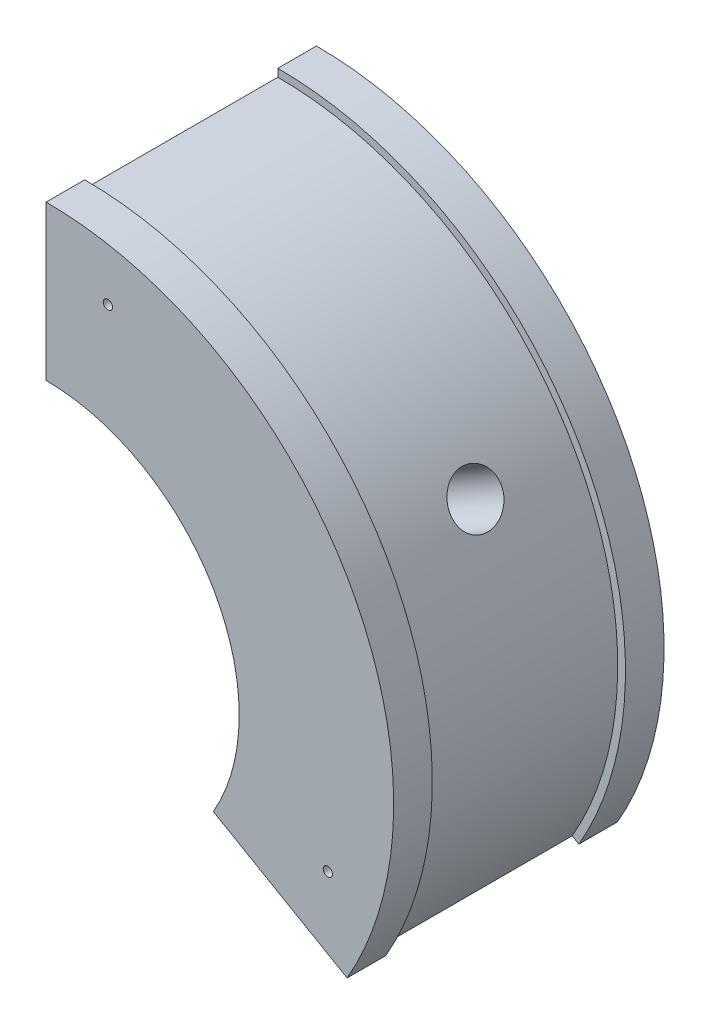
ISO-10303-21;
HEADER;
FILE_DESCRIPTION(('STEP AP214'),'2;1');
FILE_NAME('part.step','',(''),(''),'','','');
FILE_SCHEMA(('AUTOMOTIVE_DESIGN { 1 0 10303 214 1 1 1 1 }'));
ENDSEC;
DATA;
#1=APPLICATION_CONTEXT('core data for automotive mechanical design processes');
#2=APPLICATION_PROTOCOL_DEFINITION('international standard','automotive_design',2000,#1);
#3=PRODUCT_CONTEXT('',#1,'mechanical');
#4=PRODUCT('Part','Part','',(#3));
#5=PRODUCT_RELATED_PRODUCT_CATEGORY('part','',(#4));
#6=PRODUCT_DEFINITION_FORMATION('','',#4);
#7=PRODUCT_DEFINITION_CONTEXT('part definition',#1,'design');
#8=PRODUCT_DEFINITION('design','',#6,#7);
#9=PRODUCT_DEFINITION_SHAPE('','',#8);
#10=(LENGTH_UNIT() NAMED_UNIT(*) SI_UNIT(.MILLI.,.METRE.));
#11=(NAMED_UNIT(*) PLANE_ANGLE_UNIT() SI_UNIT($,.RADIAN.));
#12=(NAMED_UNIT(*) SI_UNIT($,.STERADIAN.) SOLID_ANGLE_UNIT());
#13=UNCERTAINTY_MEASURE_WITH_UNIT(LENGTH_MEASURE(1.E-05),#10,'distance_accuracy_value','');
#14=(GEOMETRIC_REPRESENTATION_CONTEXT(3) GLOBAL_UNCERTAINTY_ASSIGNED_CONTEXT((#13)) GLOBAL_UNIT_ASSIGNED_CONTEXT((#10,
#11,#12)) REPRESENTATION_CONTEXT('',''));
#15=CARTESIAN_POINT('',(0.,0.,0.));
#16=DIRECTION('',(0.,0.,1.));
#17=DIRECTION('',(1.,0.,0.));
#18=AXIS2_PLACEMENT_3D('',#15,#16,#17);
#19=CARTESIAN_POINT('',(0.,0.,35.));
#20=DIRECTION('',(0.,0.,-1.));
#21=DIRECTION('',(-1.,0.,0.));
#22=AXIS2_PLACEMENT_3D('',#19,#20,#21);
#23=CYLINDRICAL_SURFACE('',#22,45.);
#24=CARTESIAN_POINT('',(0.,0.,5.));
#25=DIRECTION('',(0.,0.,1.));
#26=DIRECTION('',(1.,0.,0.));
#27=AXIS2_PLACEMENT_3D('',#24,#25,#26);
#28=CIRCLE('',#27,45.);
#29=CARTESIAN_POINT('',(38.9711431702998,-22.4999999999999,5.));
#30=VERTEX_POINT('',#29);
#31=CARTESIAN_POINT('',(0.,45.,5.));
#32=VERTEX_POINT('',#31);
#33=EDGE_CURVE('E170',#30,#32,#28,.T.);
#34=ORIENTED_EDGE('',*,*,#33,.F.);
#35=DIRECTION('',(0.,0.,-1.));
#36=VECTOR('',#35,1.);
#37=CARTESIAN_POINT('',(38.9711431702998,-22.4999999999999,35.));
#38=LINE('',#37,#36);
#39=CARTESIAN_POINT('',(38.9711431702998,-22.4999999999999,0.));
#40=VERTEX_POINT('',#39);
#41=EDGE_CURVE('E281',#30,#40,#38,.T.);
#42=ORIENTED_EDGE('',*,*,#41,.T.);
#43=CARTESIAN_POINT('',(0.,0.,0.));
#44=DIRECTION('',(0.,0.,1.));
#45=DIRECTION('',(1.,0.,0.));
#46=AXIS2_PLACEMENT_3D('',#43,#44,#45);
#47=CIRCLE('',#46,45.);
#48=CARTESIAN_POINT('',(0.,45.,0.));
#49=VERTEX_POINT('',#48);
#50=EDGE_CURVE('E321',#40,#49,#47,.T.);
#51=ORIENTED_EDGE('',*,*,#50,.T.);
#52=DIRECTION('',(0.,0.,-1.));
#53=VECTOR('',#52,1.);
#54=CARTESIAN_POINT('',(0.,45.,35.));
#55=LINE('',#54,#53);
#56=EDGE_CURVE('E295',#32,#49,#55,.T.);
#57=ORIENTED_EDGE('',*,*,#56,.F.);
#58=EDGE_LOOP('',(#34,#42,#51,#57));
#59=FACE_BOUND('',#58,.T.);
#60=ADVANCED_FACE('F32',(#59),#23,.T.);
#61=CARTESIAN_POINT('',(0.,0.,35.));
#62=DIRECTION('',(0.,0.,-1.));
#63=DIRECTION('',(-1.,0.,0.));
#64=AXIS2_PLACEMENT_3D('',#61,#62,#63);
#65=CYLINDRICAL_SURFACE('',#64,25.);
#66=CARTESIAN_POINT('',(0.,0.,5.));
#67=DIRECTION('',(0.,0.,1.));
#68=DIRECTION('',(1.,0.,0.));
#69=AXIS2_PLACEMENT_3D('',#66,#67,#68);
#70=CIRCLE('',#69,25.);
#71=CARTESIAN_POINT('',(0.,25.,5.));
#72=VERTEX_POINT('',#71);
#73=CARTESIAN_POINT('',(21.650635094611,-12.5,5.));
#74=VERTEX_POINT('',#73);
#75=EDGE_CURVE('E61',#72,#74,#70,.F.);
#76=ORIENTED_EDGE('',*,*,#75,.F.);
#77=DIRECTION('',(0.,0.,-1.));
#78=VECTOR('',#77,1.);
#79=CARTESIAN_POINT('',(0.,25.,35.));
#80=LINE('',#79,#78);
#81=CARTESIAN_POINT('',(0.,25.,0.));
#82=VERTEX_POINT('',#81);
#83=EDGE_CURVE('E291',#72,#82,#80,.T.);
#84=ORIENTED_EDGE('',*,*,#83,.T.);
#85=CARTESIAN_POINT('',(0.,0.,0.));
#86=DIRECTION('',(0.,0.,-1.));
#87=DIRECTION('',(1.,0.,0.));
#88=AXIS2_PLACEMENT_3D('',#85,#86,#87);
#89=CIRCLE('',#88,25.);
#90=CARTESIAN_POINT('',(21.650635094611,-12.5,0.));
#91=VERTEX_POINT('',#90);
#92=EDGE_CURVE('E319',#82,#91,#89,.T.);
#93=ORIENTED_EDGE('',*,*,#92,.T.);
#94=DIRECTION('',(0.,0.,-1.));
#95=VECTOR('',#94,1.);
#96=CARTESIAN_POINT('',(21.650635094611,-12.5,35.));
#97=LINE('',#96,#95);
#98=EDGE_CURVE('E280',#74,#91,#97,.T.);
#99=ORIENTED_EDGE('',*,*,#98,.F.);
#100=EDGE_LOOP('',(#76,#84,#93,#99));
#101=FACE_BOUND('',#100,.T.);
#102=ADVANCED_FACE('F254',(#101),#65,.F.);
#103=CARTESIAN_POINT('',(38.9711431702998,-22.4999999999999,35.));
#104=VERTEX_POINT('',#103);
#105=CARTESIAN_POINT('',(38.9711431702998,-22.4999999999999,30.));
#106=VERTEX_POINT('',#105);
#107=EDGE_CURVE('E273',#104,#106,#38,.T.);
#108=ORIENTED_EDGE('',*,*,#107,.T.);
#109=CARTESIAN_POINT('',(0.,0.,30.));
#110=DIRECTION('',(0.,0.,1.));
#111=DIRECTION('',(1.,0.,0.));
#112=AXIS2_PLACEMENT_3D('',#109,#110,#111);
#113=CIRCLE('',#112,45.);
#114=CARTESIAN_POINT('',(0.,45.,30.));
#115=VERTEX_POINT('',#114);
#116=EDGE_CURVE('E174',#106,#115,#113,.T.);
#117=ORIENTED_EDGE('',*,*,#116,.T.);
#118=CARTESIAN_POINT('',(0.,45.,35.));
#119=VERTEX_POINT('',#118);
#120=EDGE_CURVE('E296',#119,#115,#55,.T.);
#121=ORIENTED_EDGE('',*,*,#120,.F.);
#122=CARTESIAN_POINT('',(0.,0.,35.));
#123=DIRECTION('',(0.,0.,1.));
#124=DIRECTION('',(1.,0.,0.));
#125=AXIS2_PLACEMENT_3D('',#122,#123,#124);
#126=CIRCLE('',#125,45.);
#127=EDGE_CURVE('E277',#104,#119,#126,.T.);
#128=ORIENTED_EDGE('',*,*,#127,.F.);
#129=EDGE_LOOP('',(#108,#117,#121,#128));
#130=FACE_BOUND('',#129,.T.);
#131=ADVANCED_FACE('F34',(#130),#23,.T.);
#132=CARTESIAN_POINT('',(0.,45.,35.));
#133=DIRECTION('',(1.,0.,0.));
#134=DIRECTION('',(0.,1.,0.));
#135=AXIS2_PLACEMENT_3D('',#132,#133,#134);
#136=PLANE('',#135);
#137=CARTESIAN_POINT('',(0.,37.,17.5));
#138=DIRECTION('',(-1.,0.,0.));
#139=DIRECTION('',(0.,0.,1.));
#140=AXIS2_PLACEMENT_3D('',#137,#138,#139);
#141=CIRCLE('',#140,2.75);
#142=CARTESIAN_POINT('',(0.,37.,20.25));
#143=VERTEX_POINT('',#142);
#144=EDGE_CURVE('E156',#143,#143,#141,.T.);
#145=ORIENTED_EDGE('',*,*,#144,.F.);
#146=EDGE_LOOP('',(#145));
#147=FACE_BOUND('',#146,.T.);
#148=ORIENTED_EDGE('',*,*,#120,.T.);
#149=DIRECTION('',(0.,-1.,0.));
#150=VECTOR('',#149,1.);
#151=CARTESIAN_POINT('',(0.,45.,30.));
#152=LINE('',#151,#150);
#153=CARTESIAN_POINT('',(0.,44.,30.));
#154=VERTEX_POINT('',#153);
#155=EDGE_CURVE('E177',#115,#154,#152,.T.);
#156=ORIENTED_EDGE('',*,*,#155,.T.);
#157=DIRECTION('',(0.,0.,-1.));
#158=VECTOR('',#157,1.);
#159=CARTESIAN_POINT('',(0.,44.,30.));
#160=LINE('',#159,#158);
#161=CARTESIAN_POINT('',(0.,44.,5.));
#162=VERTEX_POINT('',#161);
#163=EDGE_CURVE('E167',#154,#162,#160,.T.);
#164=ORIENTED_EDGE('',*,*,#163,.T.);
#165=DIRECTION('',(0.,-1.,0.));
#166=VECTOR('',#165,1.);
#167=CARTESIAN_POINT('',(0.,45.,5.));
#168=LINE('',#167,#166);
#169=EDGE_CURVE('E172',#32,#162,#168,.T.);
#170=ORIENTED_EDGE('',*,*,#169,.F.);
#171=ORIENTED_EDGE('',*,*,#56,.T.);
#172=DIRECTION('',(0.,-1.,0.));
#173=VECTOR('',#172,1.);
#174=CARTESIAN_POINT('',(0.,45.,0.));
#175=LINE('',#174,#173);
#176=EDGE_CURVE('E324',#49,#82,#175,.T.);
#177=ORIENTED_EDGE('',*,*,#176,.T.);
#178=ORIENTED_EDGE('',*,*,#83,.F.);
#179=DIRECTION('',(0.,-1.,0.));
#180=VECTOR('',#179,1.);
#181=CARTESIAN_POINT('',(0.,45.,5.));
#182=LINE('',#181,#180);
#183=CARTESIAN_POINT('',(0.,30.,5.));
#184=VERTEX_POINT('',#183);
#185=EDGE_CURVE('E353',#184,#72,#182,.T.);
#186=ORIENTED_EDGE('',*,*,#185,.F.);
#187=DIRECTION('',(0.,0.,-1.));
#188=VECTOR('',#187,1.);
#189=CARTESIAN_POINT('',(0.,30.,30.));
#190=LINE('',#189,#188);
#191=CARTESIAN_POINT('',(0.,30.,30.));
#192=VERTEX_POINT('',#191);
#193=EDGE_CURVE('E325',#192,#184,#190,.T.);
#194=ORIENTED_EDGE('',*,*,#193,.F.);
#195=DIRECTION('',(0.,-1.,0.));
#196=VECTOR('',#195,1.);
#197=CARTESIAN_POINT('',(0.,45.,30.));
#198=LINE('',#197,#196);
#199=CARTESIAN_POINT('',(0.,25.,30.));
#200=VERTEX_POINT('',#199);
#201=EDGE_CURVE('E328',#192,#200,#198,.T.);
#202=ORIENTED_EDGE('',*,*,#201,.T.);
#203=CARTESIAN_POINT('',(0.,25.,35.));
#204=VERTEX_POINT('',#203);
#205=EDGE_CURVE('E292',#204,#200,#80,.T.);
#206=ORIENTED_EDGE('',*,*,#205,.F.);
#207=DIRECTION('',(0.,-1.,0.));
#208=VECTOR('',#207,1.);
#209=CARTESIAN_POINT('',(0.,45.,35.));
#210=LINE('',#209,#208);
#211=EDGE_CURVE('E339',#119,#204,#210,.T.);
#212=ORIENTED_EDGE('',*,*,#211,.F.);
#213=EDGE_LOOP('',(#148,#156,#164,#170,#171,#177,#178,#186,#194,#202,#206,#212));
#214=FACE_BOUND('',#213,.T.);
#215=ADVANCED_FACE('F264',(#147,#214),#136,.F.);
#216=ORIENTED_EDGE('',*,*,#205,.T.);
#217=CARTESIAN_POINT('',(0.,0.,30.));
#218=DIRECTION('',(0.,0.,1.));
#219=DIRECTION('',(1.,0.,0.));
#220=AXIS2_PLACEMENT_3D('',#217,#218,#219);
#221=CIRCLE('',#220,25.);
#222=CARTESIAN_POINT('',(21.650635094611,-12.4999999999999,30.));
#223=VERTEX_POINT('',#222);
#224=EDGE_CURVE('E351',#200,#223,#221,.F.);
#225=ORIENTED_EDGE('',*,*,#224,.T.);
#226=CARTESIAN_POINT('',(21.650635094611,-12.5,35.));
#227=VERTEX_POINT('',#226);
#228=EDGE_CURVE('E283',#227,#223,#97,.T.);
#229=ORIENTED_EDGE('',*,*,#228,.F.);
#230=CARTESIAN_POINT('',(0.,0.,35.));
#231=DIRECTION('',(0.,0.,-1.));
#232=DIRECTION('',(1.,0.,0.));
#233=AXIS2_PLACEMENT_3D('',#230,#231,#232);
#234=CIRCLE('',#233,25.);
#235=EDGE_CURVE('E343',#204,#227,#234,.T.);
#236=ORIENTED_EDGE('',*,*,#235,.F.);
#237=EDGE_LOOP('',(#216,#225,#229,#236));
#238=FACE_BOUND('',#237,.T.);
#239=ADVANCED_FACE('F261',(#238),#65,.F.);
#240=CARTESIAN_POINT('',(21.650635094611,-12.4999999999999,35.));
#241=DIRECTION('',(0.499999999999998,0.86602540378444,0.));
#242=DIRECTION('',(-0.86602540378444,0.499999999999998,0.));
#243=AXIS2_PLACEMENT_3D('',#240,#241,#242);
#244=PLANE('',#243);
#245=CARTESIAN_POINT('',(32.0429399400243,-18.4999999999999,17.5));
#246=DIRECTION('',(-0.499999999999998,-0.86602540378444,0.));
#247=DIRECTION('',(0.86602540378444,-0.499999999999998,0.));
#248=AXIS2_PLACEMENT_3D('',#245,#246,#247);
#249=CIRCLE('',#248,2.75);
#250=CARTESIAN_POINT('',(34.4245098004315,-19.8749999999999,17.5));
#251=VERTEX_POINT('',#250);
#252=EDGE_CURVE('E141',#251,#251,#249,.T.);
#253=ORIENTED_EDGE('',*,*,#252,.F.);
#254=EDGE_LOOP('',(#253));
#255=FACE_BOUND('',#254,.T.);
#256=DIRECTION('',(0.,0.,-1.));
#257=VECTOR('',#256,1.);
#258=CARTESIAN_POINT('',(38.1051177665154,-21.9999999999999,30.));
#259=LINE('',#258,#257);
#260=CARTESIAN_POINT('',(38.1051177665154,-21.9999999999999,5.));
#261=VERTEX_POINT('',#260);
#262=CARTESIAN_POINT('',(38.1051177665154,-21.9999999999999,30.));
#263=VERTEX_POINT('',#262);
#264=EDGE_CURVE('E164',#261,#263,#259,.F.);
#265=ORIENTED_EDGE('',*,*,#264,.T.);
#266=DIRECTION('',(0.86602540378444,-0.499999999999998,0.));
#267=VECTOR('',#266,1.);
#268=CARTESIAN_POINT('',(21.650635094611,-12.4999999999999,30.));
#269=LINE('',#268,#267);
#270=EDGE_CURVE('E12',#263,#106,#269,.T.);
#271=ORIENTED_EDGE('',*,*,#270,.T.);
#272=ORIENTED_EDGE('',*,*,#107,.F.);
#273=DIRECTION('',(0.86602540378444,-0.499999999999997,0.));
#274=VECTOR('',#273,1.);
#275=CARTESIAN_POINT('',(21.650635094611,-12.4999999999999,35.));
#276=LINE('',#275,#274);
#277=EDGE_CURVE('E285',#227,#104,#276,.T.);
#278=ORIENTED_EDGE('',*,*,#277,.F.);
#279=ORIENTED_EDGE('',*,*,#228,.T.);
#280=DIRECTION('',(0.86602540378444,-0.499999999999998,0.));
#281=VECTOR('',#280,1.);
#282=CARTESIAN_POINT('',(21.650635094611,-12.4999999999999,30.));
#283=LINE('',#282,#281);
#284=CARTESIAN_POINT('',(25.9807621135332,-14.9999999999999,30.));
#285=VERTEX_POINT('',#284);
#286=EDGE_CURVE('E209',#223,#285,#283,.T.);
#287=ORIENTED_EDGE('',*,*,#286,.T.);
#288=DIRECTION('',(0.,0.,-1.));
#289=VECTOR('',#288,1.);
#290=CARTESIAN_POINT('',(25.9807621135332,-14.9999999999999,30.));
#291=LINE('',#290,#289);
#292=CARTESIAN_POINT('',(25.9807621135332,-14.9999999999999,5.));
#293=VERTEX_POINT('',#292);
#294=EDGE_CURVE('E299',#293,#285,#291,.F.);
#295=ORIENTED_EDGE('',*,*,#294,.F.);
#296=DIRECTION('',(0.86602540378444,-0.499999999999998,0.));
#297=VECTOR('',#296,1.);
#298=CARTESIAN_POINT('',(21.650635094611,-12.4999999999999,5.));
#299=LINE('',#298,#297);
#300=EDGE_CURVE('E298',#74,#293,#299,.T.);
#301=ORIENTED_EDGE('',*,*,#300,.F.);
#302=ORIENTED_EDGE('',*,*,#98,.T.);
#303=DIRECTION('',(0.86602540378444,-0.499999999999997,0.));
#304=VECTOR('',#303,1.);
#305=CARTESIAN_POINT('',(21.650635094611,-12.4999999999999,0.));
#306=LINE('',#305,#304);
#307=EDGE_CURVE('E287',#91,#40,#306,.T.);
#308=ORIENTED_EDGE('',*,*,#307,.T.);
#309=ORIENTED_EDGE('',*,*,#41,.F.);
#310=DIRECTION('',(0.86602540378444,-0.499999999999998,0.));
#311=VECTOR('',#310,1.);
#312=CARTESIAN_POINT('',(21.650635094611,-12.4999999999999,5.));
#313=LINE('',#312,#311);
#314=EDGE_CURVE('E45',#261,#30,#313,.T.);
#315=ORIENTED_EDGE('',*,*,#314,.F.);
#316=EDGE_LOOP('',(#265,#271,#272,#278,#279,#287,#295,#301,#302,#308,#309,#315));
#317=FACE_BOUND('',#316,.T.);
#318=ADVANCED_FACE('F312',(#255,#317),#244,.F.);
#319=CARTESIAN_POINT('',(0.,0.,35.));
#320=DIRECTION('',(0.,0.,1.));
#321=DIRECTION('',(1.,0.,0.));
#322=AXIS2_PLACEMENT_3D('',#319,#320,#321);
#323=PLANE('',#322);
#324=CARTESIAN_POINT('',(36.4759526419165,-11.8217967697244,35.));
#325=DIRECTION('',(0.,0.,1.));
#326=DIRECTION('',(1.,0.,0.));
#327=AXIS2_PLACEMENT_3D('',#324,#325,#326);
#328=CIRCLE('',#327,0.599999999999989);
#329=CARTESIAN_POINT('',(37.0759526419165,-11.8217967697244,35.));
#330=VERTEX_POINT('',#329);
#331=EDGE_CURVE('E439',#330,#330,#328,.T.);
#332=ORIENTED_EDGE('',*,*,#331,.F.);
#333=EDGE_LOOP('',(#332));
#334=FACE_BOUND('',#333,.T.);
#335=CARTESIAN_POINT('',(8.,37.5,35.));
#336=DIRECTION('',(0.,0.,1.));
#337=DIRECTION('',(1.,0.,0.));
#338=AXIS2_PLACEMENT_3D('',#335,#336,#337);
#339=CIRCLE('',#338,0.599999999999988);
#340=CARTESIAN_POINT('',(8.59999999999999,37.5,35.));
#341=VERTEX_POINT('',#340);
#342=EDGE_CURVE('E151',#341,#341,#339,.T.);
#343=ORIENTED_EDGE('',*,*,#342,.F.);
#344=EDGE_LOOP('',(#343));
#345=FACE_BOUND('',#344,.T.);
#346=ORIENTED_EDGE('',*,*,#127,.T.);
#347=ORIENTED_EDGE('',*,*,#211,.T.);
#348=ORIENTED_EDGE('',*,*,#235,.T.);
#349=ORIENTED_EDGE('',*,*,#277,.T.);
#350=EDGE_LOOP('',(#346,#347,#348,#349));
#351=FACE_BOUND('',#350,.T.);
#352=ADVANCED_FACE('F345',(#334,#345,#351),#323,.T.);
#353=CARTESIAN_POINT('',(0.,0.,0.));
#354=DIRECTION('',(0.,0.,1.));
#355=DIRECTION('',(1.,0.,0.));
#356=AXIS2_PLACEMENT_3D('',#353,#354,#355);
#357=PLANE('',#356);
#358=CARTESIAN_POINT('',(36.4759526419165,-11.8217967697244,0.));
#359=DIRECTION('',(0.,0.,1.));
#360=DIRECTION('',(1.,0.,0.));
#361=AXIS2_PLACEMENT_3D('',#358,#359,#360);
#362=CIRCLE('',#361,0.599999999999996);
#363=CARTESIAN_POINT('',(37.0759526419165,-11.8217967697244,0.));
#364=VERTEX_POINT('',#363);
#365=EDGE_CURVE('E434',#364,#364,#362,.T.);
#366=ORIENTED_EDGE('',*,*,#365,.T.);
#367=EDGE_LOOP('',(#366));
#368=FACE_BOUND('',#367,.T.);
#369=CARTESIAN_POINT('',(8.,37.5,0.));
#370=DIRECTION('',(0.,0.,1.));
#371=DIRECTION('',(1.,0.,0.));
#372=AXIS2_PLACEMENT_3D('',#369,#370,#371);
#373=CIRCLE('',#372,0.599999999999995);
#374=CARTESIAN_POINT('',(8.59999999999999,37.5,0.));
#375=VERTEX_POINT('',#374);
#376=EDGE_CURVE('E436',#375,#375,#373,.T.);
#377=ORIENTED_EDGE('',*,*,#376,.T.);
#378=EDGE_LOOP('',(#377));
#379=FACE_BOUND('',#378,.T.);
#380=ORIENTED_EDGE('',*,*,#50,.F.);
#381=ORIENTED_EDGE('',*,*,#307,.F.);
#382=ORIENTED_EDGE('',*,*,#92,.F.);
#383=ORIENTED_EDGE('',*,*,#176,.F.);
#384=EDGE_LOOP('',(#380,#381,#382,#383));
#385=FACE_BOUND('',#384,.T.);
#386=ADVANCED_FACE('F322',(#368,#379,#385),#357,.F.);
#387=CARTESIAN_POINT('',(0.,0.,30.));
#388=DIRECTION('',(0.,0.,-1.));
#389=DIRECTION('',(-1.,0.,0.));
#390=AXIS2_PLACEMENT_3D('',#387,#388,#389);
#391=CYLINDRICAL_SURFACE('',#390,30.);
#392=CARTESIAN_POINT('',(27.473562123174,12.0500366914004,17.5));
#393=CARTESIAN_POINT('',(27.4735601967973,12.0500447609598,17.6847593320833));
#394=CARTESIAN_POINT('',(27.4672815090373,12.0643877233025,17.8696383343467));
#395=CARTESIAN_POINT('',(27.4422068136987,12.1213124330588,18.2342632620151));
#396=CARTESIAN_POINT('',(27.423397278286,12.1639246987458,18.4140034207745));
#397=CARTESIAN_POINT('',(27.3734486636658,12.2759131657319,18.7630179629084));
#398=CARTESIAN_POINT('',(27.3423173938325,12.3452724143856,18.9322988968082));
#399=CARTESIAN_POINT('',(27.2680626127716,12.5084274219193,19.2557296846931));
#400=CARTESIAN_POINT('',(27.2249413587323,12.6022185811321,19.4098823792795));
#401=CARTESIAN_POINT('',(27.1270332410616,12.8116134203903,19.6993892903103));
#402=CARTESIAN_POINT('',(27.0722016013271,12.9273006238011,19.8346679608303));
#403=CARTESIAN_POINT('',(26.9517516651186,13.1765778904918,20.0819354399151));
#404=CARTESIAN_POINT('',(26.8861328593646,13.3101687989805,20.1939231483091));
#405=CARTESIAN_POINT('',(26.7450358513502,13.5914620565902,20.3916953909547));
#406=CARTESIAN_POINT('',(26.6695329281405,13.7391995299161,20.4774123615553));
#407=CARTESIAN_POINT('',(26.5103121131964,14.0439623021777,20.6197775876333));
#408=CARTESIAN_POINT('',(26.4265944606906,14.2009873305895,20.6764266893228));
#409=CARTESIAN_POINT('',(26.2532476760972,14.518940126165,20.7588248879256));
#410=CARTESIAN_POINT('',(26.1636439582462,14.6798494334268,20.7846986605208));
#411=CARTESIAN_POINT('',(25.9805778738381,15.0014599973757,20.8051976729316));
#412=CARTESIAN_POINT('',(25.8871156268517,15.162161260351,20.7998238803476));
#413=CARTESIAN_POINT('',(25.6994620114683,15.4780901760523,20.7580810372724));
#414=CARTESIAN_POINT('',(25.6052755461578,15.6333384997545,20.721846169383));
#415=CARTESIAN_POINT('',(25.4187211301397,15.9348696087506,20.6196189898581));
#416=CARTESIAN_POINT('',(25.3263532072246,16.0811522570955,20.5536262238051));
#417=CARTESIAN_POINT('',(25.1463255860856,16.3612381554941,20.3936114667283));
#418=CARTESIAN_POINT('',(25.0586762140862,16.4950144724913,20.2995307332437));
#419=CARTESIAN_POINT('',(24.8913832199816,16.746398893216,20.0860533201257));
#420=CARTESIAN_POINT('',(24.8117398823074,16.8640064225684,19.9666557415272));
#421=CARTESIAN_POINT('',(24.6630093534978,17.0807897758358,19.7051810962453));
#422=CARTESIAN_POINT('',(24.5939802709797,17.1798647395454,19.5629873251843));
#423=CARTESIAN_POINT('',(24.4696836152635,17.3564478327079,19.2603598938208));
#424=CARTESIAN_POINT('',(24.4144160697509,17.4339559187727,19.0999261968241));
#425=CARTESIAN_POINT('',(24.3198792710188,17.5655934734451,18.7652778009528));
#426=CARTESIAN_POINT('',(24.2806145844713,17.6197162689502,18.591059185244));
#427=CARTESIAN_POINT('',(24.2197674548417,17.7032640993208,18.2338345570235));
#428=CARTESIAN_POINT('',(24.1981843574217,17.7326900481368,18.050828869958));
#429=CARTESIAN_POINT('',(24.1736979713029,17.766056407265,17.6822485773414));
#430=CARTESIAN_POINT('',(24.1706976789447,17.770129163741,17.4966923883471));
#431=CARTESIAN_POINT('',(24.1832480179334,17.7530454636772,17.1273803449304));
#432=CARTESIAN_POINT('',(24.1987983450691,17.7318894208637,16.9436244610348));
#433=CARTESIAN_POINT('',(24.2477150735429,17.6649372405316,16.5836097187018));
#434=CARTESIAN_POINT('',(24.2810356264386,17.6192045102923,16.4073328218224));
#435=CARTESIAN_POINT('',(24.3640640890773,17.5042103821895,16.0667178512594));
#436=CARTESIAN_POINT('',(24.4137724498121,17.4349483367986,15.9023801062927));
#437=CARTESIAN_POINT('',(24.5277909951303,17.2741767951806,15.5895668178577));
#438=CARTESIAN_POINT('',(24.5921603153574,17.182577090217,15.441159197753));
#439=CARTESIAN_POINT('',(24.7328534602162,16.9794342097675,15.1651092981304));
#440=CARTESIAN_POINT('',(24.8091776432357,16.8678904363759,15.0374676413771));
#441=CARTESIAN_POINT('',(24.9712614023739,16.6270030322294,14.8060066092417));
#442=CARTESIAN_POINT('',(25.0570608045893,16.4975836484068,14.7022939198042));
#443=CARTESIAN_POINT('',(25.2347056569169,16.2245529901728,14.5223705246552));
#444=CARTESIAN_POINT('',(25.3265510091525,16.0809419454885,14.4461593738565));
#445=CARTESIAN_POINT('',(25.5129191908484,15.7835880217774,14.3235817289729));
#446=CARTESIAN_POINT('',(25.6074358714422,15.6298674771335,14.2771517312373));
#447=CARTESIAN_POINT('',(25.7962699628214,15.3161989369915,14.2152472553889));
#448=CARTESIAN_POINT('',(25.8905873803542,15.1562511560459,14.1997717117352));
#449=CARTESIAN_POINT('',(26.0756972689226,14.8355020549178,14.2002321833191));
#450=CARTESIAN_POINT('',(26.1665057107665,14.6747096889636,14.2160029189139));
#451=CARTESIAN_POINT('',(26.3426655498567,14.3560831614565,14.2781603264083));
#452=CARTESIAN_POINT('',(26.4280169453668,14.1982490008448,14.3245470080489));
#453=CARTESIAN_POINT('',(26.5911971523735,13.8902350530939,14.4465715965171));
#454=CARTESIAN_POINT('',(26.6690274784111,13.7400537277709,14.522203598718));
#455=CARTESIAN_POINT('',(26.8155675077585,13.4518218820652,14.7005546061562));
#456=CARTESIAN_POINT('',(26.8842772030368,13.3137713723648,14.803273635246));
#457=CARTESIAN_POINT('',(27.0116849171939,13.0533533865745,15.0335006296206));
#458=CARTESIAN_POINT('',(27.0703303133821,12.9310691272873,15.1611318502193));
#459=CARTESIAN_POINT('',(27.1763084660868,12.7068360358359,15.4373104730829));
#460=CARTESIAN_POINT('',(27.2236385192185,12.6048920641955,15.5858628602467));
#461=CARTESIAN_POINT('',(27.3064862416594,12.4244006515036,15.9001691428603));
#462=CARTESIAN_POINT('',(27.3419677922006,12.3459248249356,16.0659736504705));
#463=CARTESIAN_POINT('',(27.4004952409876,12.2154827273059,16.4096133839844));
#464=CARTESIAN_POINT('',(27.4235549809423,12.1634869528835,16.5874349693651));
#465=CARTESIAN_POINT('',(27.4513775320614,12.100519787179,16.8885269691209));
#466=CARTESIAN_POINT('',(27.4596918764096,12.0816188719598,17.0098813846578));
#467=CARTESIAN_POINT('',(27.4707847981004,12.0563746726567,17.2541395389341));
#468=CARTESIAN_POINT('',(27.4735634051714,12.0500313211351,17.3770432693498));
#469=CARTESIAN_POINT('',(27.473562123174,12.0500366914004,17.5));
#470=B_SPLINE_CURVE_WITH_KNOTS('',3,(#392,#393,#394,#395,#396,#397,#398,#399,#400,#401,#402,
#403,#404,#405,#406,#407,#408,#409,#410,#411,#412,#413,#414,#415,#416,#417,#418,#419,#420,#421,
#422,#423,#424,#425,#426,#427,#428,#429,#430,#431,#432,#433,#434,#435,#436,#437,#438,#439,#440,
#441,#442,#443,#444,#445,#446,#447,#448,#449,#450,#451,#452,#453,#454,#455,#456,#457,#458,#459,
#460,#461,#462,#463,#464,#465,#466,#467,#468,#469),.UNSPECIFIED.,.T.,.F.,(4,2,2,2,2,2,2,2,2,2,2,
2,2,2,2,2,2,2,2,2,2,2,2,2,2,2,2,2,2,2,2,2,2,2,2,2,2,2,4),(0.,0.553828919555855,1.10825670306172,
1.66233365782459,2.21630637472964,2.77243646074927,3.32859281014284,3.88616771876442,
4.44372639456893,4.99901853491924,5.55429348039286,6.10716636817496,6.66004769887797,
7.21409350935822,7.76815899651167,8.32515733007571,8.8821567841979,9.43931507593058,
9.9964527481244,10.5506796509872,11.1048974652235,11.6576922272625,12.2105022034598,
12.7655827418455,13.3206799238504,13.8782061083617,14.4357232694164,14.9920476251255,
15.5483528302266,16.1017232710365,16.6550938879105,17.2083528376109,17.7616122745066,
18.3176817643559,18.873883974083,19.4317665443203,19.9890261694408,20.3575994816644,
20.7261708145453),.UNSPECIFIED.);
#471=CARTESIAN_POINT('',(27.473562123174,12.0500366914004,17.5));
#472=VERTEX_POINT('',#471);
#473=EDGE_CURVE('E180',#472,#472,#470,.T.);
#474=ORIENTED_EDGE('',*,*,#473,.F.);
#475=EDGE_LOOP('',(#474));
#476=FACE_BOUND('',#475,.T.);
#477=ORIENTED_EDGE('',*,*,#193,.T.);
#478=CARTESIAN_POINT('',(0.,0.,5.));
#479=DIRECTION('',(0.,0.,1.));
#480=DIRECTION('',(1.,0.,0.));
#481=AXIS2_PLACEMENT_3D('',#478,#479,#480);
#482=CIRCLE('',#481,30.);
#483=EDGE_CURVE('E187',#293,#184,#482,.T.);
#484=ORIENTED_EDGE('',*,*,#483,.F.);
#485=ORIENTED_EDGE('',*,*,#294,.T.);
#486=CARTESIAN_POINT('',(0.,0.,30.));
#487=DIRECTION('',(0.,0.,1.));
#488=DIRECTION('',(1.,0.,0.));
#489=AXIS2_PLACEMENT_3D('',#486,#487,#488);
#490=CIRCLE('',#489,30.);
#491=EDGE_CURVE('E357',#285,#192,#490,.T.);
#492=ORIENTED_EDGE('',*,*,#491,.T.);
#493=EDGE_LOOP('',(#477,#484,#485,#492));
#494=FACE_BOUND('',#493,.T.);
#495=ADVANCED_FACE('F189',(#476,#494),#391,.F.);
#496=CARTESIAN_POINT('',(0.,0.,30.));
#497=DIRECTION('',(0.,0.,1.));
#498=DIRECTION('',(1.,0.,0.));
#499=AXIS2_PLACEMENT_3D('',#496,#497,#498);
#500=PLANE('',#499);
#501=ORIENTED_EDGE('',*,*,#491,.F.);
#502=ORIENTED_EDGE('',*,*,#286,.F.);
#503=ORIENTED_EDGE('',*,*,#224,.F.);
#504=ORIENTED_EDGE('',*,*,#201,.F.);
#505=EDGE_LOOP('',(#501,#502,#503,#504));
#506=FACE_BOUND('',#505,.T.);
#507=ADVANCED_FACE('F361',(#506),#500,.F.);
#508=CARTESIAN_POINT('',(0.,0.,5.));
#509=DIRECTION('',(0.,0.,1.));
#510=DIRECTION('',(1.,0.,0.));
#511=AXIS2_PLACEMENT_3D('',#508,#509,#510);
#512=PLANE('',#511);
#513=ORIENTED_EDGE('',*,*,#185,.T.);
#514=ORIENTED_EDGE('',*,*,#75,.T.);
#515=ORIENTED_EDGE('',*,*,#300,.T.);
#516=ORIENTED_EDGE('',*,*,#483,.T.);
#517=EDGE_LOOP('',(#513,#514,#515,#516));
#518=FACE_BOUND('',#517,.T.);
#519=ADVANCED_FACE('F199',(#518),#512,.T.);
#520=CARTESIAN_POINT('',(10.8258891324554,6.24900998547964,17.5));
#521=DIRECTION('',(-0.866025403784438,-0.500000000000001,0.));
#522=DIRECTION('',(0.500000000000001,-0.866025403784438,0.));
#523=AXIS2_PLACEMENT_3D('',#520,#521,#522);
#524=CYLINDRICAL_SURFACE('',#523,3.29999999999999);
#525=CARTESIAN_POINT('',(39.6482931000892,19.0791208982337,17.5));
#526=CARTESIAN_POINT('',(39.6482904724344,19.0791287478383,17.3149176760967));
#527=CARTESIAN_POINT('',(39.6415070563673,19.0932428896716,17.1297077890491));
#528=CARTESIAN_POINT('',(39.6144610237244,19.1492926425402,16.7644080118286));
#529=CARTESIAN_POINT('',(39.5941829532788,19.1912601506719,16.5843242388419));
#530=CARTESIAN_POINT('',(39.5404840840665,19.3016544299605,16.2346206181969));
#531=CARTESIAN_POINT('',(39.5070705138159,19.3700666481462,16.0649950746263));
#532=CARTESIAN_POINT('',(39.427677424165,19.531161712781,15.7409427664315));
#533=CARTESIAN_POINT('',(39.3817006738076,19.6238392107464,15.586512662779));
#534=CARTESIAN_POINT('',(39.2779058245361,19.830771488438,15.2968675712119));
#535=CARTESIAN_POINT('',(39.2200658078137,19.9450661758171,15.1616889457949));
#536=CARTESIAN_POINT('',(39.0937114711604,20.191603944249,14.9146959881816));
#537=CARTESIAN_POINT('',(39.0251966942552,20.3238477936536,14.8028826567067));
#538=CARTESIAN_POINT('',(38.8788438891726,20.6024330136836,14.6056764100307));
#539=CARTESIAN_POINT('',(38.8009950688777,20.748790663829,14.5203144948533));
#540=CARTESIAN_POINT('',(38.637823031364,21.0510831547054,14.378632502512));
#541=CARTESIAN_POINT('',(38.5524999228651,21.2070178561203,14.3223120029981));
#542=CARTESIAN_POINT('',(38.3766771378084,21.523553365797,14.2404148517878));
#543=CARTESIAN_POINT('',(38.2861875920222,21.6841447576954,14.2147800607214));
#544=CARTESIAN_POINT('',(38.1023225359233,22.0056197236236,14.1948023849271));
#545=CARTESIAN_POINT('',(38.0089470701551,22.1665032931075,14.2004590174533));
#546=CARTESIAN_POINT('',(37.8221921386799,22.483673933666,14.2428558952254));
#547=CARTESIAN_POINT('',(37.7288130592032,22.6399696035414,14.2795335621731));
#548=CARTESIAN_POINT('',(37.5447054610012,22.9439903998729,14.382834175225));
#549=CARTESIAN_POINT('',(37.4539769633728,23.0917154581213,14.4494573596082));
#550=CARTESIAN_POINT('',(37.2779830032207,23.3747688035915,14.6108278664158));
#551=CARTESIAN_POINT('',(37.1927231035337,23.5100845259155,14.7056032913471));
#552=CARTESIAN_POINT('',(37.0306112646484,23.7646088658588,14.9205675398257));
#553=CARTESIAN_POINT('',(36.9537594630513,23.8838172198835,15.0407567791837));
#554=CARTESIAN_POINT('',(36.8109515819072,24.1033415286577,15.3034896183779));
#555=CARTESIAN_POINT('',(36.7450227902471,24.2036102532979,15.4460875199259));
#556=CARTESIAN_POINT('',(36.6266664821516,24.3823467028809,15.7494001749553));
#557=CARTESIAN_POINT('',(36.5742389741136,24.4608144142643,15.9101149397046));
#558=CARTESIAN_POINT('',(36.4848270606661,24.5939801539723,16.2451361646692));
#559=CARTESIAN_POINT('',(36.4478440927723,24.648675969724,16.4194438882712));
#560=CARTESIAN_POINT('',(36.3907368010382,24.7329110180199,16.7766856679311));
#561=CARTESIAN_POINT('',(36.3706121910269,24.7624506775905,16.9596195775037));
#562=CARTESIAN_POINT('',(36.3480271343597,24.7955909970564,17.3284445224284));
#563=CARTESIAN_POINT('',(36.3455238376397,24.7992545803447,17.5143272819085));
#564=CARTESIAN_POINT('',(36.3581649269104,24.7807175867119,17.8841920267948));
#565=CARTESIAN_POINT('',(36.3733091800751,24.7585172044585,18.0681740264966));
#566=CARTESIAN_POINT('',(36.4206322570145,24.6888496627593,18.4287981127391));
#567=CARTESIAN_POINT('',(36.4527913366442,24.6414117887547,18.6054484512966));
#568=CARTESIAN_POINT('',(36.532909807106,24.5224715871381,18.946649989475));
#569=CARTESIAN_POINT('',(36.580869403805,24.450968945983,19.1112010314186));
#570=CARTESIAN_POINT('',(36.6909135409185,24.2855248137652,19.423881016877));
#571=CARTESIAN_POINT('',(36.7530251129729,24.1915403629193,19.5719777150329));
#572=CARTESIAN_POINT('',(36.8890711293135,23.9835741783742,19.8472196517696));
#573=CARTESIAN_POINT('',(36.9630057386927,23.8695921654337,19.9743645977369));
#574=CARTESIAN_POINT('',(37.1202632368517,23.6242943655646,20.2043517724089));
#575=CARTESIAN_POINT('',(37.2036046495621,23.4929442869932,20.3071447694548));
#576=CARTESIAN_POINT('',(37.376724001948,23.216525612,20.4851727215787));
#577=CARTESIAN_POINT('',(37.4665018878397,23.0714571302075,20.5604079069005));
#578=CARTESIAN_POINT('',(37.6494708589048,22.77165182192,20.68109943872));
#579=CARTESIAN_POINT('',(37.7426583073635,22.6169251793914,20.7265865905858));
#580=CARTESIAN_POINT('',(37.9296372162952,22.3019315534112,20.7865916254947));
#581=CARTESIAN_POINT('',(38.0234286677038,22.1416646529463,20.8011099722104));
#582=CARTESIAN_POINT('',(38.2086299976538,21.8205149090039,20.7987603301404));
#583=CARTESIAN_POINT('',(38.3000451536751,21.6596345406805,20.7819692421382));
#584=CARTESIAN_POINT('',(38.4782283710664,21.3414900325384,20.717637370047));
#585=CARTESIAN_POINT('',(38.5649964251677,21.1842258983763,20.6700965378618));
#586=CARTESIAN_POINT('',(38.7316795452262,20.8779172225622,20.5456332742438));
#587=CARTESIAN_POINT('',(38.8115948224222,20.7288724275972,20.4687117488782));
#588=CARTESIAN_POINT('',(38.9627092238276,20.4434195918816,20.2876800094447));
#589=CARTESIAN_POINT('',(39.0339085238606,20.3070112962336,20.1835703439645));
#590=CARTESIAN_POINT('',(39.1662252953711,20.0506282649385,19.9508296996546));
#591=CARTESIAN_POINT('',(39.227318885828,19.9306925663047,19.8221421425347));
#592=CARTESIAN_POINT('',(39.338028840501,19.7112818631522,19.5439930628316));
#593=CARTESIAN_POINT('',(39.3876424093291,19.6118118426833,19.3945264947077));
#594=CARTESIAN_POINT('',(39.4745308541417,19.4363331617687,19.0788246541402));
#595=CARTESIAN_POINT('',(39.5117859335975,19.3603621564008,18.9125630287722));
#596=CARTESIAN_POINT('',(39.5731700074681,19.234582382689,18.5682989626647));
#597=CARTESIAN_POINT('',(39.5973142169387,19.1847432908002,18.3903104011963));
#598=CARTESIAN_POINT('',(39.6258896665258,19.1256237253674,18.092712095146));
#599=CARTESIAN_POINT('',(39.6342839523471,19.1082103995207,17.9750207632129));
#600=CARTESIAN_POINT('',(39.6454865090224,19.0849564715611,17.7382372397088));
#601=CARTESIAN_POINT('',(39.6482947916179,19.0791158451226,17.6191450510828));
#602=CARTESIAN_POINT('',(39.6482931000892,19.0791208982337,17.5));
#603=B_SPLINE_CURVE_WITH_KNOTS('',3,(#525,#526,#527,#528,#529,#530,#531,#532,#533,#534,#535,
#536,#537,#538,#539,#540,#541,#542,#543,#544,#545,#546,#547,#548,#549,#550,#551,#552,#553,#554,
#555,#556,#557,#558,#559,#560,#561,#562,#563,#564,#565,#566,#567,#568,#569,#570,#571,#572,#573,
#574,#575,#576,#577,#578,#579,#580,#581,#582,#583,#584,#585,#586,#587,#588,#589,#590,#591,#592,
#593,#594,#595,#596,#597,#598,#599,#600,#601,#602),.UNSPECIFIED.,.T.,.F.,(4,2,2,2,2,2,2,2,2,2,2,
2,2,2,2,2,2,2,2,2,2,2,2,2,2,2,2,2,2,2,2,2,2,2,2,2,2,2,4),(0.,0.5548119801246,1.11026041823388,
1.66540361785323,2.22042455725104,2.77648030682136,3.33255986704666,3.88928868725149,
4.44600941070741,5.0016736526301,5.55732932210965,6.11186674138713,6.66640857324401,
7.22150583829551,7.77661218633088,8.33308504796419,8.88955825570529,9.44608324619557,
10.0025987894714,10.5577605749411,11.1129181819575,11.667432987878,12.2219550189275,
12.7775452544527,13.3331432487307,13.8898550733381,14.4465622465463,15.00269200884,
15.5588134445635,16.1135707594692,16.6683289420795,17.2230700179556,17.777799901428,
18.333822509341,18.8899803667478,19.4470248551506,20.003421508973,20.3605773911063,
20.7177325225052),.UNSPECIFIED.);
#604=CARTESIAN_POINT('',(39.6482931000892,19.0791208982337,17.5));
#605=VERTEX_POINT('',#604);
#606=EDGE_CURVE('E163',#605,#605,#603,.T.);
#607=ORIENTED_EDGE('',*,*,#606,.T.);
#608=EDGE_LOOP('',(#607));
#609=FACE_BOUND('',#608,.T.);
#610=ORIENTED_EDGE('',*,*,#473,.T.);
#611=EDGE_LOOP('',(#610));
#612=FACE_BOUND('',#611,.T.);
#613=ADVANCED_FACE('F193',(#609,#612),#524,.F.);
#614=CARTESIAN_POINT('',(0.5,0.5,30.));
#615=DIRECTION('',(0.,0.,1.));
#616=DIRECTION('',(1.,0.,0.));
#617=AXIS2_PLACEMENT_3D('',#614,#615,#616);
#618=PLANE('',#617);
#619=ORIENTED_EDGE('',*,*,#116,.F.);
#620=ORIENTED_EDGE('',*,*,#270,.F.);
#621=CARTESIAN_POINT('',(0.,0.,30.));
#622=DIRECTION('',(0.,0.,1.));
#623=DIRECTION('',(1.,0.,0.));
#624=AXIS2_PLACEMENT_3D('',#621,#622,#623);
#625=CIRCLE('',#624,44.);
#626=EDGE_CURVE('E160',#263,#154,#625,.T.);
#627=ORIENTED_EDGE('',*,*,#626,.T.);
#628=ORIENTED_EDGE('',*,*,#155,.F.);
#629=EDGE_LOOP('',(#619,#620,#627,#628));
#630=FACE_BOUND('',#629,.T.);
#631=ADVANCED_FACE('F198',(#630),#618,.F.);
#632=CARTESIAN_POINT('',(0.5,0.5,5.));
#633=DIRECTION('',(0.,0.,1.));
#634=DIRECTION('',(1.,0.,0.));
#635=AXIS2_PLACEMENT_3D('',#632,#633,#634);
#636=PLANE('',#635);
#637=ORIENTED_EDGE('',*,*,#169,.T.);
#638=CARTESIAN_POINT('',(0.,0.,5.));
#639=DIRECTION('',(0.,0.,1.));
#640=DIRECTION('',(1.,0.,0.));
#641=AXIS2_PLACEMENT_3D('',#638,#639,#640);
#642=CIRCLE('',#641,44.);
#643=EDGE_CURVE('E53',#261,#162,#642,.T.);
#644=ORIENTED_EDGE('',*,*,#643,.F.);
#645=ORIENTED_EDGE('',*,*,#314,.T.);
#646=ORIENTED_EDGE('',*,*,#33,.T.);
#647=EDGE_LOOP('',(#637,#644,#645,#646));
#648=FACE_BOUND('',#647,.T.);
#649=ADVANCED_FACE('F216',(#648),#636,.T.);
#650=CARTESIAN_POINT('',(0.,0.,30.));
#651=DIRECTION('',(0.,0.,-1.));
#652=DIRECTION('',(-1.,0.,0.));
#653=AXIS2_PLACEMENT_3D('',#650,#651,#652);
#654=CYLINDRICAL_SURFACE('',#653,44.);
#655=ORIENTED_EDGE('',*,*,#606,.F.);
#656=EDGE_LOOP('',(#655));
#657=FACE_BOUND('',#656,.T.);
#658=ORIENTED_EDGE('',*,*,#626,.F.);
#659=ORIENTED_EDGE('',*,*,#264,.F.);
#660=ORIENTED_EDGE('',*,*,#643,.T.);
#661=ORIENTED_EDGE('',*,*,#163,.F.);
#662=EDGE_LOOP('',(#658,#659,#660,#661));
#663=FACE_BOUND('',#662,.T.);
#664=ADVANCED_FACE('F211',(#657,#663),#654,.T.);
#665=CARTESIAN_POINT('',(0.,37.,17.5));
#666=DIRECTION('',(-1.,0.,0.));
#667=DIRECTION('',(0.,0.,1.));
#668=AXIS2_PLACEMENT_3D('',#665,#666,#667);
#669=CYLINDRICAL_SURFACE('',#668,2.75);
#670=CARTESIAN_POINT('',(8.33166247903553,37.,20.25));
#671=CARTESIAN_POINT('',(8.35950792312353,37.0184717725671,20.2499999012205));
#672=CARTESIAN_POINT('',(8.38581765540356,37.0392819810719,20.2498146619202));
#673=CARTESIAN_POINT('',(8.43461223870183,37.0849927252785,20.2487811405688));
#674=CARTESIAN_POINT('',(8.45709480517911,37.1098956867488,20.2479324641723));
#675=CARTESIAN_POINT('',(8.49758934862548,37.1630704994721,20.2452896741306));
#676=CARTESIAN_POINT('',(8.51560057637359,37.1913429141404,20.2434954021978));
#677=CARTESIAN_POINT('',(8.54663988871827,37.2504051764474,20.2387357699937));
#678=CARTESIAN_POINT('',(8.55966896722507,37.2811945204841,20.2357706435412));
#679=CARTESIAN_POINT('',(8.58034623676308,37.3441517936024,20.22856298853));
#680=CARTESIAN_POINT('',(8.58803030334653,37.3763089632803,20.2243292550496));
#681=CARTESIAN_POINT('',(8.59802050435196,37.4412534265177,20.2145669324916));
#682=CARTESIAN_POINT('',(8.6003263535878,37.4740407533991,20.2090382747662));
#683=CARTESIAN_POINT('',(8.599595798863,37.5396311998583,20.1967428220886));
#684=CARTESIAN_POINT('',(8.5965098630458,37.5724316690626,20.1899650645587));
#685=CARTESIAN_POINT('',(8.58509386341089,37.6368830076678,20.1754387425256));
#686=CARTESIAN_POINT('',(8.57676280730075,37.668533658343,20.1676899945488));
#687=CARTESIAN_POINT('',(8.55475656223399,37.73104779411,20.1512547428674));
#688=CARTESIAN_POINT('',(8.54089680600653,37.76183998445,20.1425442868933));
#689=CARTESIAN_POINT('',(8.50826021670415,37.8206285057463,20.1248833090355));
#690=CARTESIAN_POINT('',(8.48948197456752,37.8486240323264,20.1159327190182));
#691=CARTESIAN_POINT('',(8.44673016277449,37.9020477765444,20.098005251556));
#692=CARTESIAN_POINT('',(8.4225996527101,37.9273540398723,20.089038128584));
#693=CARTESIAN_POINT('',(8.37012139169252,37.9735307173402,20.0720312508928));
#694=CARTESIAN_POINT('',(8.34177368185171,37.9944011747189,20.0639914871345));
#695=CARTESIAN_POINT('',(8.28209544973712,38.0306781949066,20.0496230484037));
#696=CARTESIAN_POINT('',(8.25082708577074,38.0461755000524,20.0432664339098));
#697=CARTESIAN_POINT('',(8.18576612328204,38.0715840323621,20.0326664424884));
#698=CARTESIAN_POINT('',(8.15197517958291,38.0814988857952,20.0284216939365));
#699=CARTESIAN_POINT('',(8.08549725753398,38.0947720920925,20.0227014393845));
#700=CARTESIAN_POINT('',(8.05291095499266,38.0985578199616,20.0210457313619));
#701=CARTESIAN_POINT('',(7.98752717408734,38.1007606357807,20.0200849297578));
#702=CARTESIAN_POINT('',(7.95472976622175,38.0991794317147,20.0207790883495));
#703=CARTESIAN_POINT('',(7.89162738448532,38.0909451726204,20.0243526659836));
#704=CARTESIAN_POINT('',(7.8612808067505,38.0845561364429,20.0271182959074));
#705=CARTESIAN_POINT('',(7.8021342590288,38.0672730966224,20.0344655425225));
#706=CARTESIAN_POINT('',(7.77333448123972,38.0563785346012,20.0390473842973));
#707=CARTESIAN_POINT('',(7.71716514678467,38.0300882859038,20.0498283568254));
#708=CARTESIAN_POINT('',(7.68986010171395,38.0145727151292,20.0560700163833));
#709=CARTESIAN_POINT('',(7.63817731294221,37.9796437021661,20.0696592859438));
#710=CARTESIAN_POINT('',(7.61380053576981,37.9602289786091,20.0770072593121));
#711=CARTESIAN_POINT('',(7.56675177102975,37.9164184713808,20.0929247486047));
#712=CARTESIAN_POINT('',(7.54434151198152,37.8917595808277,20.1015444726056));
#713=CARTESIAN_POINT('',(7.50392080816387,37.8391271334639,20.1189948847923));
#714=CARTESIAN_POINT('',(7.48591172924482,37.81115255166,20.1278256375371));
#715=CARTESIAN_POINT('',(7.45397828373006,37.7511367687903,20.1456223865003));
#716=CARTESIAN_POINT('',(7.44029051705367,37.7189650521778,20.1545746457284));
#717=CARTESIAN_POINT('',(7.41866423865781,37.6525396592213,20.1716787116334));
#718=CARTESIAN_POINT('',(7.41072532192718,37.618286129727,20.179830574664));
#719=CARTESIAN_POINT('',(7.4010107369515,37.5491326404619,20.1948446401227));
#720=CARTESIAN_POINT('',(7.3991525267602,37.5142478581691,20.2017229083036));
#721=CARTESIAN_POINT('',(7.40155874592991,37.444441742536,20.2140793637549));
#722=CARTESIAN_POINT('',(7.4058214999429,37.4095204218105,20.2195579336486));
#723=CARTESIAN_POINT('',(7.42014045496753,37.3422119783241,20.228827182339));
#724=CARTESIAN_POINT('',(7.4299467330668,37.3097799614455,20.2326789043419));
#725=CARTESIAN_POINT('',(7.45493608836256,37.2469214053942,20.2390743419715));
#726=CARTESIAN_POINT('',(7.47011853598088,37.2164946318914,20.2416182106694));
#727=CARTESIAN_POINT('',(7.50505358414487,37.1592231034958,20.2455337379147));
#728=CARTESIAN_POINT('',(7.52469936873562,37.1323147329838,20.2469297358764));
#729=CARTESIAN_POINT('',(7.56818679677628,37.0820998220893,20.2488892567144));
#730=CARTESIAN_POINT('',(7.59202853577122,37.0587933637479,20.2494527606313));
#731=CARTESIAN_POINT('',(7.643365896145,37.0163399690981,20.2500340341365));
#732=CARTESIAN_POINT('',(7.6708786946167,36.9972137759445,20.2500491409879));
#733=CARTESIAN_POINT('',(7.7286988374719,36.963799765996,20.2498126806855));
#734=CARTESIAN_POINT('',(7.75900624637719,36.9495120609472,20.2495611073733));
#735=CARTESIAN_POINT('',(7.82185164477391,36.9260680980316,20.2490314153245));
#736=CARTESIAN_POINT('',(7.8544070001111,36.9169583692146,20.2487530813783));
#737=CARTESIAN_POINT('',(7.92058976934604,36.9043247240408,20.2483425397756));
#738=CARTESIAN_POINT('',(7.95421732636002,36.9008015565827,20.2482103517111));
#739=CARTESIAN_POINT('',(8.0216348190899,36.8994414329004,20.2481609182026));
#740=CARTESIAN_POINT('',(8.05542491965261,36.9016127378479,20.2482439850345));
#741=CARTESIAN_POINT('',(8.12214456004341,36.9115978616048,20.2485832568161));
#742=CARTESIAN_POINT('',(8.15507463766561,36.9194080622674,20.2488393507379));
#743=CARTESIAN_POINT('',(8.21262576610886,36.9382947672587,20.2493200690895));
#744=CARTESIAN_POINT('',(8.23757557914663,36.9483851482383,20.2495405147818));
#745=CARTESIAN_POINT('',(8.28590188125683,36.9718133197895,20.2498805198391));
#746=CARTESIAN_POINT('',(8.30927837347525,36.9851511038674,20.2500000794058));
#747=CARTESIAN_POINT('',(8.33166247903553,37.,20.25));
#748=B_SPLINE_CURVE_WITH_KNOTS('',3,(#670,#671,#672,#673,#674,#675,#676,#677,#678,#679,#680,
#681,#682,#683,#684,#685,#686,#687,#688,#689,#690,#691,#692,#693,#694,#695,#696,#697,#698,#699,
#700,#701,#702,#703,#704,#705,#706,#707,#708,#709,#710,#711,#712,#713,#714,#715,#716,#717,#718,
#719,#720,#721,#722,#723,#724,#725,#726,#727,#728,#729,#730,#731,#732,#733,#734,#735,#736,#737,
#738,#739,#740,#741,#742,#743,#744,#745,#746,#747),.UNSPECIFIED.,.T.,.F.,(4,2,2,2,2,2,2,2,2,2,2,
2,2,2,2,2,2,2,2,2,2,2,2,2,2,2,2,2,2,2,2,2,2,2,2,2,2,2,4),(0.,0.10015013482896,0.200359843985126,
0.300586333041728,0.400792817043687,0.500320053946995,0.599852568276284,0.700304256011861,
0.800774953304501,0.904925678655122,1.00910627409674,1.11688250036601,1.22465767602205,
1.3305122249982,1.436297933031,1.53432840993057,1.63232769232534,1.72530575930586,
1.81829535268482,1.91394596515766,2.00962806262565,2.11242815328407,2.21526010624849,
2.32301101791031,2.43075433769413,2.53702890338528,2.64327438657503,2.74507347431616,
2.84686064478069,2.94642941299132,3.04600044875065,3.14605488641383,3.24611163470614,
3.34705382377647,3.44800954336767,3.54911180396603,3.65014925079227,3.73065705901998,
3.81116470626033),.UNSPECIFIED.);
#749=CARTESIAN_POINT('',(8.33166247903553,37.,20.25));
#750=VERTEX_POINT('',#749);
#751=EDGE_CURVE('E142',#750,#750,#748,.T.);
#752=ORIENTED_EDGE('',*,*,#751,.T.);
#753=EDGE_LOOP('',(#752));
#754=FACE_BOUND('',#753,.T.);
#755=CARTESIAN_POINT('',(8.59999999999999,37.5,14.795836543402));
#756=CARTESIAN_POINT('',(8.59999927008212,37.4671488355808,14.7897627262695));
#757=CARTESIAN_POINT('',(8.59729433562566,37.4341773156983,14.7842908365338));
#758=CARTESIAN_POINT('',(8.58644344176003,37.3689347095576,14.7746604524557));
#759=CARTESIAN_POINT('',(8.57829594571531,37.3366638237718,14.7705023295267));
#760=CARTESIAN_POINT('',(8.5567125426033,37.2737777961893,14.7634789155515));
#761=CARTESIAN_POINT('',(8.54327474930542,37.2431632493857,14.7606140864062));
#762=CARTESIAN_POINT('',(8.51145812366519,37.1845268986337,14.7560401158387));
#763=CARTESIAN_POINT('',(8.49307940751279,37.156505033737,14.7543309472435));
#764=CARTESIAN_POINT('',(8.45202868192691,37.1040554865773,14.7518444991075));
#765=CARTESIAN_POINT('',(8.4293852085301,37.0796057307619,14.7510612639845));
#766=CARTESIAN_POINT('',(8.38036094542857,37.0347808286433,14.75012834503));
#767=CARTESIAN_POINT('',(8.35397997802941,37.0144058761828,14.7499786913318));
#768=CARTESIAN_POINT('',(8.29796240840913,36.9781363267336,14.7500263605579));
#769=CARTESIAN_POINT('',(8.26829873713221,36.9622835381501,14.7502268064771));
#770=CARTESIAN_POINT('',(8.20674329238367,36.9357477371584,14.7507185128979));
#771=CARTESIAN_POINT('',(8.17485145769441,36.925064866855,14.7510097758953));
#772=CARTESIAN_POINT('',(8.10952585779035,36.9091180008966,14.7514903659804));
#773=CARTESIAN_POINT('',(8.0760836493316,36.903888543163,14.751679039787));
#774=CARTESIAN_POINT('',(8.00879549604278,36.8991170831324,14.7518499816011));
#775=CARTESIAN_POINT('',(7.97494955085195,36.8995750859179,14.7518322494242));
#776=CARTESIAN_POINT('',(7.90782432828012,36.9061644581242,14.7515994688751));
#777=CARTESIAN_POINT('',(7.87454490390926,36.9122943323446,14.7513844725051));
#778=CARTESIAN_POINT('',(7.80948644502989,36.9300512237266,14.7508755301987));
#779=CARTESIAN_POINT('',(7.77770744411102,36.9416783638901,14.7505815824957));
#780=CARTESIAN_POINT('',(7.71653481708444,36.9701079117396,14.7501258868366));
#781=CARTESIAN_POINT('',(7.68714237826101,36.9869128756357,14.7499642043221));
#782=CARTESIAN_POINT('',(7.6315959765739,37.0252194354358,14.7500491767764));
#783=CARTESIAN_POINT('',(7.60544197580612,37.0467209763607,14.7502958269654));
#784=CARTESIAN_POINT('',(7.55717850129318,37.0937468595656,14.7514982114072));
#785=CARTESIAN_POINT('',(7.53505978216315,37.1192617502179,14.7524522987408));
#786=CARTESIAN_POINT('',(7.49542904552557,37.1735974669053,14.7553501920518));
#787=CARTESIAN_POINT('',(7.47791658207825,37.2024179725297,14.7572939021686));
#788=CARTESIAN_POINT('',(7.44813508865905,37.2621988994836,14.7623656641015));
#789=CARTESIAN_POINT('',(7.43581620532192,37.2931354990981,14.7654818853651));
#790=CARTESIAN_POINT('',(7.41648026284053,37.3564695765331,14.7730152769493));
#791=CARTESIAN_POINT('',(7.40946298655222,37.3888669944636,14.7774323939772));
#792=CARTESIAN_POINT('',(7.40085368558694,37.4541184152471,14.7875537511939));
#793=CARTESIAN_POINT('',(7.39925291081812,37.4869715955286,14.793255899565));
#794=CARTESIAN_POINT('',(7.4013891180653,37.552277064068,14.8058217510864));
#795=CARTESIAN_POINT('',(7.40512678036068,37.5847293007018,14.8126856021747));
#796=CARTESIAN_POINT('',(7.41790038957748,37.649227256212,14.8275241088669));
#797=CARTESIAN_POINT('',(7.42707120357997,37.6812406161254,14.8355229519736));
#798=CARTESIAN_POINT('',(7.45049236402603,37.7431842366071,14.8521316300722));
#799=CARTESIAN_POINT('',(7.46474402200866,37.7731139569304,14.8607416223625));
#800=CARTESIAN_POINT('',(7.49862959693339,37.8313755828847,14.8784965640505));
#801=CARTESIAN_POINT('',(7.51846192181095,37.8595900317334,14.8876489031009));
#802=CARTESIAN_POINT('',(7.56273294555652,37.9122889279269,14.9055819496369));
#803=CARTESIAN_POINT('',(7.58717261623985,37.9367725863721,14.9143625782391));
#804=CARTESIAN_POINT('',(7.64036643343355,37.9815433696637,14.9310216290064));
#805=CARTESIAN_POINT('',(7.66916171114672,38.0017855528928,14.9388900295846));
#806=CARTESIAN_POINT('',(7.73015744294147,38.0370515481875,14.9529651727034));
#807=CARTESIAN_POINT('',(7.7623564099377,38.0520776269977,14.959172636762));
#808=CARTESIAN_POINT('',(7.82738673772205,38.0756160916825,14.9690505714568));
#809=CARTESIAN_POINT('',(7.86008637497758,38.0844407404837,14.9728415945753));
#810=CARTESIAN_POINT('',(7.92668329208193,38.096462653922,14.9780336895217));
#811=CARTESIAN_POINT('',(7.96057988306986,38.0996631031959,14.9794361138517));
#812=CARTESIAN_POINT('',(8.02597134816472,38.1002639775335,14.9796987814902));
#813=CARTESIAN_POINT('',(8.05746264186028,38.0980670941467,14.9787355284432));
#814=CARTESIAN_POINT('',(8.11957935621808,38.088801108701,14.974720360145));
#815=CARTESIAN_POINT('',(8.1502047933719,38.0817320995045,14.9716684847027));
#816=CARTESIAN_POINT('',(8.20954608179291,38.0630732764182,14.9637673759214));
#817=CARTESIAN_POINT('',(8.23827398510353,38.051516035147,14.9589311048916));
#818=CARTESIAN_POINT('',(8.29339743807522,38.0242746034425,14.9478289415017));
#819=CARTESIAN_POINT('',(8.31979244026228,38.008589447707,14.9415627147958));
#820=CARTESIAN_POINT('',(8.3712929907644,37.9724327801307,14.9275940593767));
#821=CARTESIAN_POINT('',(8.396212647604,37.9517220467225,14.9198260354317));
#822=CARTESIAN_POINT('',(8.44231404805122,37.9066910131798,14.9036596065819));
#823=CARTESIAN_POINT('',(8.46349398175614,37.8823689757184,14.8952608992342));
#824=CARTESIAN_POINT('',(8.50297150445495,37.828932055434,14.8777464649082));
#825=CARTESIAN_POINT('',(8.52097707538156,37.7996042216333,14.8686206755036));
#826=CARTESIAN_POINT('',(8.55174910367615,37.7382233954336,14.8507461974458));
#827=CARTESIAN_POINT('',(8.56451804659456,37.7061717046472,14.8419973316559));
#828=CARTESIAN_POINT('',(8.58287134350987,37.6452909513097,14.8266261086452));
#829=CARTESIAN_POINT('',(8.58926284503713,37.6167330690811,14.8198843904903));
#830=CARTESIAN_POINT('',(8.59782715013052,37.5588156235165,14.80721273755));
#831=CARTESIAN_POINT('',(8.60000065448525,37.5294561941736,14.8012826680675));
#832=CARTESIAN_POINT('',(8.59999999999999,37.5,14.795836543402));
#833=B_SPLINE_CURVE_WITH_KNOTS('',3,(#755,#756,#757,#758,#759,#760,#761,#762,#763,#764,#765,
#766,#767,#768,#769,#770,#771,#772,#773,#774,#775,#776,#777,#778,#779,#780,#781,#782,#783,#784,
#785,#786,#787,#788,#789,#790,#791,#792,#793,#794,#795,#796,#797,#798,#799,#800,#801,#802,#803,
#804,#805,#806,#807,#808,#809,#810,#811,#812,#813,#814,#815,#816,#817,#818,#819,#820,#821,#822,
#823,#824,#825,#826,#827,#828,#829,#830,#831,#832),.UNSPECIFIED.,.T.,.F.,(4,2,2,2,2,2,2,2,2,2,2,
2,2,2,2,2,2,2,2,2,2,2,2,2,2,2,2,2,2,2,2,2,2,2,2,2,2,2,4),(0.,0.100120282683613,
0.200268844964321,0.300453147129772,0.400635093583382,0.5001691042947,0.599707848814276,
0.700139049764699,0.800573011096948,0.901639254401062,1.00270558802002,1.10374528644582,
1.20478724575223,1.3058791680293,1.40696990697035,1.50782604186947,1.60867240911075,
1.70852740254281,1.8083783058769,1.90806782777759,2.00777005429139,2.11005747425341,
2.21237131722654,2.31892117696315,2.42549353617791,2.53314361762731,2.64074685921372,
2.74244379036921,2.84408311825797,2.93837240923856,3.03265990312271,3.12627553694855,
3.21991308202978,3.31944764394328,3.41903024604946,3.52535129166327,3.63162181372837,
3.72141018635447,3.81118364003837),.UNSPECIFIED.);
#834=CARTESIAN_POINT('',(8.59999999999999,37.5,14.795836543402));
#835=VERTEX_POINT('',#834);
#836=EDGE_CURVE('E148',#835,#835,#833,.T.);
#837=ORIENTED_EDGE('',*,*,#836,.T.);
#838=EDGE_LOOP('',(#837));
#839=FACE_BOUND('',#838,.T.);
#840=CARTESIAN_POINT('',(9.99999999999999,37.,17.5));
#841=DIRECTION('',(-1.,0.,0.));
#842=DIRECTION('',(0.,0.,1.));
#843=AXIS2_PLACEMENT_3D('',#840,#841,#842);
#844=CIRCLE('',#843,2.75);
#845=CARTESIAN_POINT('',(9.99999999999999,37.,20.25));
#846=VERTEX_POINT('',#845);
#847=EDGE_CURVE('E145',#846,#846,#844,.T.);
#848=ORIENTED_EDGE('',*,*,#847,.F.);
#849=EDGE_LOOP('',(#848));
#850=FACE_BOUND('',#849,.T.);
#851=ORIENTED_EDGE('',*,*,#144,.T.);
#852=EDGE_LOOP('',(#851));
#853=FACE_BOUND('',#852,.T.);
#854=ADVANCED_FACE('F215',(#754,#839,#850,#853),#669,.F.);
#855=CARTESIAN_POINT('',(9.99999999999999,37.,17.5));
#856=DIRECTION('',(-1.,0.,0.));
#857=DIRECTION('',(0.,0.,1.));
#858=AXIS2_PLACEMENT_3D('',#855,#856,#857);
#859=CONICAL_SURFACE('',#858,2.75,1.02974425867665);
#860=CARTESIAN_POINT('',(11.6523667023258,37.,17.5));
#861=VERTEX_POINT('',#860);
#862=VERTEX_LOOP('',#861);
#863=FACE_BOUND('',#862,.T.);
#864=ORIENTED_EDGE('',*,*,#847,.T.);
#865=EDGE_LOOP('',(#864));
#866=FACE_BOUND('',#865,.T.);
#867=ADVANCED_FACE('F223',(#863,#866),#859,.F.);
#868=CARTESIAN_POINT('',(32.0429399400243,-18.4999999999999,17.5));
#869=DIRECTION('',(-0.499999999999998,-0.86602540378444,0.));
#870=DIRECTION('',(0.86602540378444,-0.499999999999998,0.));
#871=AXIS2_PLACEMENT_3D('',#868,#869,#870);
#872=CYLINDRICAL_SURFACE('',#871,2.75);
#873=CARTESIAN_POINT('',(37.0759526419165,-11.8217967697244,14.9460061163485));
#874=CARTESIAN_POINT('',(37.0759524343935,-11.8531781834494,14.9522699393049));
#875=CARTESIAN_POINT('',(37.0734859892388,-11.8846954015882,14.9578751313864));
#876=CARTESIAN_POINT('',(37.0635523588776,-11.9472053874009,14.967339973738));
#877=CARTESIAN_POINT('',(37.0560861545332,-11.9781982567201,14.9711999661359));
#878=CARTESIAN_POINT('',(37.036227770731,-12.0388496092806,14.9768497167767));
#879=CARTESIAN_POINT('',(37.0238244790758,-12.0685049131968,14.9786347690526));
#880=CARTESIAN_POINT('',(36.9944109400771,-12.1254885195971,14.979951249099));
#881=CARTESIAN_POINT('',(36.9774012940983,-12.1528171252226,14.9794829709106));
#882=CARTESIAN_POINT('',(36.939920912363,-12.2034973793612,14.9763893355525));
#883=CARTESIAN_POINT('',(36.9195779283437,-12.2269480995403,14.9738332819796));
#884=CARTESIAN_POINT('',(36.8756912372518,-12.2703065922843,14.9668717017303));
#885=CARTESIAN_POINT('',(36.8521470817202,-12.2902138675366,14.96246591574));
#886=CARTESIAN_POINT('',(36.8019033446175,-12.3265152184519,14.9520184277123));
#887=CARTESIAN_POINT('',(36.7751398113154,-12.3428095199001,14.9459387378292));
#888=CARTESIAN_POINT('',(36.7196411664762,-12.3709643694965,14.932632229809));
#889=CARTESIAN_POINT('',(36.6909054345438,-12.3828235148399,14.9254050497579));
#890=CARTESIAN_POINT('',(36.6299463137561,-12.4026472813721,14.909696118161));
#891=CARTESIAN_POINT('',(36.5976220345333,-12.4102599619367,14.9011611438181));
#892=CARTESIAN_POINT('',(36.5322266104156,-12.4200669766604,14.8838270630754));
#893=CARTESIAN_POINT('',(36.4991552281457,-12.4222595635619,14.875027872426));
#894=CARTESIAN_POINT('',(36.4313559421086,-12.4211443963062,14.8572166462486));
#895=CARTESIAN_POINT('',(36.3966291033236,-12.4175520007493,14.8482164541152));
#896=CARTESIAN_POINT('',(36.3281420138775,-12.4043496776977,14.8309675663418));
#897=CARTESIAN_POINT('',(36.2943817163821,-12.3947400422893,14.822718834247));
#898=CARTESIAN_POINT('',(36.2291753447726,-12.3697986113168,14.8074523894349));
#899=CARTESIAN_POINT('',(36.1977083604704,-12.3545291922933,14.8004224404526));
#900=CARTESIAN_POINT('',(36.1377096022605,-12.3185998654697,14.7877492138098));
#901=CARTESIAN_POINT('',(36.1091770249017,-12.297941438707,14.7821055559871));
#902=CARTESIAN_POINT('',(36.0571390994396,-12.2527638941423,14.77251663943));
#903=CARTESIAN_POINT('',(36.0334735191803,-12.2284421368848,14.7685102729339));
#904=CARTESIAN_POINT('',(35.990511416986,-12.1760481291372,14.7618234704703));
#905=CARTESIAN_POINT('',(35.9712143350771,-12.147976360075,14.7591428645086));
#906=CARTESIAN_POINT('',(35.9380125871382,-12.0896057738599,14.7549882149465));
#907=CARTESIAN_POINT('',(35.9239920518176,-12.0593746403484,14.7534873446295));
#908=CARTESIAN_POINT('',(35.9011367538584,-11.9969836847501,14.7513475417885));
#909=CARTESIAN_POINT('',(35.8923020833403,-11.964823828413,14.7507086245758));
#910=CARTESIAN_POINT('',(35.8800510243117,-11.8993523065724,14.7500077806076));
#911=CARTESIAN_POINT('',(35.8766560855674,-11.8660366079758,14.7499481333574));
#912=CARTESIAN_POINT('',(35.87544628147,-11.7993045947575,14.7501240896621));
#913=CARTESIAN_POINT('',(35.8776316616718,-11.7658882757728,14.7503597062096));
#914=CARTESIAN_POINT('',(35.8875677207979,-11.6995783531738,14.7508802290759));
#915=CARTESIAN_POINT('',(35.8953694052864,-11.6666923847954,14.7511655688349));
#916=CARTESIAN_POINT('',(35.9163745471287,-11.6026924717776,14.7516037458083));
#917=CARTESIAN_POINT('',(35.9295780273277,-11.5715785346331,14.7517565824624));
#918=CARTESIAN_POINT('',(35.9610372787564,-11.511958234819,14.7518494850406));
#919=CARTESIAN_POINT('',(35.9793006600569,-11.4834558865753,14.7517892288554));
#920=CARTESIAN_POINT('',(36.0203522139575,-11.4299216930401,14.7514860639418));
#921=CARTESIAN_POINT('',(36.043140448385,-11.4048898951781,14.7512431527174));
#922=CARTESIAN_POINT('',(36.0925891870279,-11.359012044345,14.7507129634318));
#923=CARTESIAN_POINT('',(36.119248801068,-11.3381650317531,14.7504256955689));
#924=CARTESIAN_POINT('',(36.1756902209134,-11.3012396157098,14.7500331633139));
#925=CARTESIAN_POINT('',(36.2054720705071,-11.2851612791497,14.7499279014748));
#926=CARTESIAN_POINT('',(36.2673103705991,-11.2582316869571,14.7501832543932));
#927=CARTESIAN_POINT('',(36.2993667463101,-11.247380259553,14.7505438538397));
#928=CARTESIAN_POINT('',(36.3648292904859,-11.2312139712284,14.752032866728));
#929=CARTESIAN_POINT('',(36.3982353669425,-11.2258987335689,14.7531612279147));
#930=CARTESIAN_POINT('',(36.4651670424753,-11.2209628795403,14.7564487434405));
#931=CARTESIAN_POINT('',(36.49868993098,-11.2213004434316,14.758600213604));
#932=CARTESIAN_POINT('',(36.5651117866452,-11.227521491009,14.7641303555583));
#933=CARTESIAN_POINT('',(36.598010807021,-11.2334044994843,14.7675089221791));
#934=CARTESIAN_POINT('',(36.6619737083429,-11.2504100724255,14.7755553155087));
#935=CARTESIAN_POINT('',(36.6930500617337,-11.2614907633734,14.7802127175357));
#936=CARTESIAN_POINT('',(36.752795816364,-11.2884745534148,14.7907979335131));
#937=CARTESIAN_POINT('',(36.781465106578,-11.3043778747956,14.796725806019));
#938=CARTESIAN_POINT('',(36.836046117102,-11.3407323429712,14.8097909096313));
#939=CARTESIAN_POINT('',(36.8619138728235,-11.3612437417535,14.8169438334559));
#940=CARTESIAN_POINT('',(36.9098208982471,-11.4060623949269,14.8321311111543));
#941=CARTESIAN_POINT('',(36.9318590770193,-11.4303707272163,14.8401657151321));
#942=CARTESIAN_POINT('',(36.9724104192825,-11.483151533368,14.8570828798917));
#943=CARTESIAN_POINT('',(36.9907502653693,-11.5117504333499,14.8659863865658));
#944=CARTESIAN_POINT('',(37.0223496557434,-11.5716057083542,14.8838709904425));
#945=CARTESIAN_POINT('',(37.035609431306,-11.6028619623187,14.8928520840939));
#946=CARTESIAN_POINT('',(37.0559535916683,-11.6649843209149,14.9097210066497));
#947=CARTESIAN_POINT('',(37.0634099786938,-11.6957201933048,14.9176411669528));
#948=CARTESIAN_POINT('',(37.0734088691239,-11.7581898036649,14.932602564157));
#949=CARTESIAN_POINT('',(37.0759528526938,-11.7899232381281,14.9396440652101));
#950=CARTESIAN_POINT('',(37.0759526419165,-11.8217967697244,14.9460061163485));
#951=B_SPLINE_CURVE_WITH_KNOTS('',3,(#873,#874,#875,#876,#877,#878,#879,#880,#881,#882,#883,
#884,#885,#886,#887,#888,#889,#890,#891,#892,#893,#894,#895,#896,#897,#898,#899,#900,#901,#902,
#903,#904,#905,#906,#907,#908,#909,#910,#911,#912,#913,#914,#915,#916,#917,#918,#919,#920,#921,
#922,#923,#924,#925,#926,#927,#928,#929,#930,#931,#932,#933,#934,#935,#936,#937,#938,#939,#940,
#941,#942,#943,#944,#945,#946,#947,#948,#949,#950),.UNSPECIFIED.,.T.,.F.,(4,2,2,2,2,2,2,2,2,2,2,
2,2,2,2,2,2,2,2,2,2,2,2,2,2,2,2,2,2,2,2,2,2,2,2,2,2,2,4),(0.,0.0958977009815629,
0.191776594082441,0.28787251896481,0.383955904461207,0.476973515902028,0.570004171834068,
0.665350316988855,0.760726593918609,0.863140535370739,0.965587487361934,1.07323097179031,
1.18086923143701,1.28735486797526,1.39381127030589,1.49581992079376,1.59781548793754,
1.69741860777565,1.79702349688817,1.89702018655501,1.99702127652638,2.09794219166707,
2.19886353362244,2.29993749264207,2.40101283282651,2.502064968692,2.60311852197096,
2.70416875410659,2.80521210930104,2.90550827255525,3.00579584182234,3.10528899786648,
3.20478674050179,3.30567016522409,3.40658228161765,3.51147456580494,3.61636207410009,
3.7137929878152,3.81119453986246),.UNSPECIFIED.);
#952=CARTESIAN_POINT('',(37.0759526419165,-11.8217967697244,14.9460061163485));
#953=VERTEX_POINT('',#952);
#954=EDGE_CURVE('E36',#953,#953,#951,.T.);
#955=ORIENTED_EDGE('',*,*,#954,.T.);
#956=EDGE_LOOP('',(#955));
#957=FACE_BOUND('',#956,.T.);
#958=CARTESIAN_POINT('',(37.0759526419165,-11.8217967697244,20.0539938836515));
#959=CARTESIAN_POINT('',(37.0759513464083,-11.7871260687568,20.0609149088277));
#960=CARTESIAN_POINT('',(37.0729389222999,-11.7525929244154,20.0686454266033));
#961=CARTESIAN_POINT('',(37.0611087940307,-11.6847500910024,20.0851048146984));
#962=CARTESIAN_POINT('',(37.0522817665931,-11.6514424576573,20.0938352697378));
#963=CARTESIAN_POINT('',(37.0291492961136,-11.5869702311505,20.1116635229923));
#964=CARTESIAN_POINT('',(37.0148545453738,-11.5558015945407,20.1207605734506));
#965=CARTESIAN_POINT('',(36.9811575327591,-11.4963183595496,20.1387804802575));
#966=CARTESIAN_POINT('',(36.9617569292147,-11.4680028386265,20.1477033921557));
#967=CARTESIAN_POINT('',(36.9178794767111,-11.4144630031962,20.1650574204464));
#968=CARTESIAN_POINT('',(36.8933129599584,-11.3893078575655,20.1734759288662));
#969=CARTESIAN_POINT('',(36.8399567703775,-11.3435334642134,20.1892111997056));
#970=CARTESIAN_POINT('',(36.811167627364,-11.3229136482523,20.1965281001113));
#971=CARTESIAN_POINT('',(36.7511040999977,-11.2875032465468,20.2095655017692));
#972=CARTESIAN_POINT('',(36.7199326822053,-11.2725536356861,20.2153279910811));
#973=CARTESIAN_POINT('',(36.6552828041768,-11.2481826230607,20.2254167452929));
#974=CARTESIAN_POINT('',(36.6218049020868,-11.2387598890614,20.2297433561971));
#975=CARTESIAN_POINT('',(36.5548928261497,-11.2260757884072,20.2368476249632));
#976=CARTESIAN_POINT('',(36.5215062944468,-11.2225918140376,20.2396783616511));
#977=CARTESIAN_POINT('',(36.4545432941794,-11.22124464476,20.2441827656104));
#978=CARTESIAN_POINT('',(36.42096683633,-11.2233811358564,20.245856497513));
#979=CARTESIAN_POINT('',(36.354952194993,-11.2331871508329,20.2482716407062));
#980=CARTESIAN_POINT('',(36.3225058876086,-11.2407999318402,20.2490224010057));
#981=CARTESIAN_POINT('',(36.2593109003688,-11.2612882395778,20.2499025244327));
#982=CARTESIAN_POINT('',(36.2285622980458,-11.2741640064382,20.2500318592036));
#983=CARTESIAN_POINT('',(36.1693490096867,-11.3049621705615,20.2499550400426));
#984=CARTESIAN_POINT('',(36.1409076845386,-11.3229294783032,20.2497458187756));
#985=CARTESIAN_POINT('',(36.0874212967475,-11.363356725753,20.2492462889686));
#986=CARTESIAN_POINT('',(36.062376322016,-11.3858167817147,20.2489559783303));
#987=CARTESIAN_POINT('',(36.0162427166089,-11.4347511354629,20.2484836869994));
#988=CARTESIAN_POINT('',(35.9951792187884,-11.4612491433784,20.2483023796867));
#989=CARTESIAN_POINT('',(35.9577987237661,-11.5174051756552,20.2481480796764));
#990=CARTESIAN_POINT('',(35.94148173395,-11.5470632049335,20.2481750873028));
#991=CARTESIAN_POINT('',(35.9140619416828,-11.6086868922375,20.2484235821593));
#992=CARTESIAN_POINT('',(35.9029575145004,-11.6406518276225,20.2486450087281));
#993=CARTESIAN_POINT('',(35.8862695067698,-11.7059917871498,20.2491596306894));
#994=CARTESIAN_POINT('',(35.8806860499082,-11.7393668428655,20.2494528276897));
#995=CARTESIAN_POINT('',(35.8751971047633,-11.8065995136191,20.2498964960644));
#996=CARTESIAN_POINT('',(35.8752945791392,-11.8404573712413,20.2500468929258));
#997=CARTESIAN_POINT('',(35.8811729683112,-11.9076762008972,20.2499268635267));
#998=CARTESIAN_POINT('',(35.8869538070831,-11.9410371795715,20.2496564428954));
#999=CARTESIAN_POINT('',(35.9040093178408,-12.0062228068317,20.2483940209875));
#1000=CARTESIAN_POINT('',(35.9152703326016,-12.0380510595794,20.2474038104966));
#1001=CARTESIAN_POINT('',(35.9429393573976,-12.0993338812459,20.2444231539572));
#1002=CARTESIAN_POINT('',(35.9593468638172,-12.128788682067,20.2424328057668));
#1003=CARTESIAN_POINT('',(35.9966073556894,-12.1841938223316,20.2372615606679));
#1004=CARTESIAN_POINT('',(36.0174147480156,-12.2101759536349,20.2340926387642));
#1005=CARTESIAN_POINT('',(36.0629137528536,-12.2582532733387,20.2264520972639));
#1006=CARTESIAN_POINT('',(36.0876052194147,-12.2803486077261,20.2219805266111));
#1007=CARTESIAN_POINT('',(36.1400724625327,-12.3200596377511,20.2117516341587));
#1008=CARTESIAN_POINT('',(36.1678445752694,-12.3376805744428,20.2059958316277));
#1009=CARTESIAN_POINT('',(36.2256766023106,-12.3680839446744,20.1933301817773));
#1010=CARTESIAN_POINT('',(36.2557368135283,-12.3808657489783,20.1864201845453));
#1011=CARTESIAN_POINT('',(36.3181410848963,-12.4016290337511,20.1714958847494));
#1012=CARTESIAN_POINT('',(36.3505245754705,-12.4094741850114,20.1634571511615));
#1013=CARTESIAN_POINT('',(36.4159940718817,-12.4197127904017,20.1467846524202));
#1014=CARTESIAN_POINT('',(36.4490802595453,-12.4221048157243,20.1381507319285));
#1015=CARTESIAN_POINT('',(36.5165243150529,-12.4214112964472,20.120368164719));
#1016=CARTESIAN_POINT('',(36.5508782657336,-12.4180954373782,20.1112129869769));
#1017=CARTESIAN_POINT('',(36.6186214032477,-12.4056051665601,20.0932997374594));
#1018=CARTESIAN_POINT('',(36.6520103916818,-12.3964295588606,20.0845417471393));
#1019=CARTESIAN_POINT('',(36.7172306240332,-12.3722555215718,20.0679666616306));
#1020=CARTESIAN_POINT('',(36.7490453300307,-12.357205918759,20.0601586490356));
#1021=CARTESIAN_POINT('',(36.809817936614,-12.3215697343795,20.0462297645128));
#1022=CARTESIAN_POINT('',(36.8387771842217,-12.3009857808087,20.0401080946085));
#1023=CARTESIAN_POINT('',(36.8913076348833,-12.2560849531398,20.0304224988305));
#1024=CARTESIAN_POINT('',(36.9150900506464,-12.2320425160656,20.0267342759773));
#1025=CARTESIAN_POINT('',(36.9583665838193,-12.1801491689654,20.0217498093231));
#1026=CARTESIAN_POINT('',(36.9778623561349,-12.1522997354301,20.0204526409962));
#1027=CARTESIAN_POINT('',(37.0106549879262,-12.0958110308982,20.020384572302));
#1028=CARTESIAN_POINT('',(37.0242949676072,-12.0673699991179,20.0214399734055));
#1029=CARTESIAN_POINT('',(37.0469087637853,-12.0088561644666,20.0256287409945));
#1030=CARTESIAN_POINT('',(37.0558864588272,-11.9787847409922,20.0287603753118));
#1031=CARTESIAN_POINT('',(37.0669661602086,-11.9274430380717,20.0355584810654));
#1032=CARTESIAN_POINT('',(37.0703417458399,-11.9063723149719,20.0387486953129));
#1033=CARTESIAN_POINT('',(37.0748353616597,-11.864116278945,20.0458569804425));
#1034=CARTESIAN_POINT('',(37.0759534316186,-11.8429309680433,20.049775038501));
#1035=CARTESIAN_POINT('',(37.0759526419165,-11.8217967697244,20.0539938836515));
#1036=B_SPLINE_CURVE_WITH_KNOTS('',3,(#958,#959,#960,#961,#962,#963,#964,#965,#966,#967,#968,
#969,#970,#971,#972,#973,#974,#975,#976,#977,#978,#979,#980,#981,#982,#983,#984,#985,#986,#987,
#988,#989,#990,#991,#992,#993,#994,#995,#996,#997,#998,#999,#1000,#1001,#1002,#1003,#1004,#1005,
#1006,#1007,#1008,#1009,#1010,#1011,#1012,#1013,#1014,#1015,#1016,#1017,#1018,#1019,#1020,#1021,
#1022,#1023,#1024,#1025,#1026,#1027,#1028,#1029,#1030,#1031,#1032,#1033,#1034,#1035),
.UNSPECIFIED.,.T.,.F.,(4,2,2,2,2,2,2,2,2,2,2,2,2,2,2,2,2,2,2,2,2,2,2,2,2,2,2,2,2,2,2,2,2,2,2,2,
2,2,4),(0.,0.105981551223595,0.212133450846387,0.318078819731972,0.423989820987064,
0.531918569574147,0.639833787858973,0.744447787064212,0.849036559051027,0.949610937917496,
1.05017969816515,1.14972114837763,1.24926714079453,1.34972008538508,1.45017562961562,
1.55124553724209,1.6523156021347,1.75335414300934,1.8543949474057,1.95548844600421,
2.0565805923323,2.15742208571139,2.25825371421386,2.35808764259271,2.45791782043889,
2.55763051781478,2.65735617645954,2.75972719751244,2.86212503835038,2.96875210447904,
3.07540093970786,3.18300039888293,3.29054885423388,3.39205960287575,3.49353109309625,
3.58776029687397,3.68191098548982,3.74651523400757,3.81111834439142),.UNSPECIFIED.);
#1037=CARTESIAN_POINT('',(37.0759526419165,-11.8217967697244,20.0539938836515));
#1038=VERTEX_POINT('',#1037);
#1039=EDGE_CURVE('E232',#1038,#1038,#1036,.T.);
#1040=ORIENTED_EDGE('',*,*,#1039,.T.);
#1041=EDGE_LOOP('',(#1040));
#1042=FACE_BOUND('',#1041,.T.);
#1043=CARTESIAN_POINT('',(37.0429399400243,-9.83974596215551,17.5));
#1044=DIRECTION('',(-0.499999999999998,-0.86602540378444,0.));
#1045=DIRECTION('',(0.86602540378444,-0.499999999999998,0.));
#1046=AXIS2_PLACEMENT_3D('',#1043,#1044,#1045);
#1047=CIRCLE('',#1046,2.75);
#1048=CARTESIAN_POINT('',(39.4245098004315,-11.2147459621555,17.5));
#1049=VERTEX_POINT('',#1048);
#1050=EDGE_CURVE('E139',#1049,#1049,#1047,.T.);
#1051=ORIENTED_EDGE('',*,*,#1050,.F.);
#1052=EDGE_LOOP('',(#1051));
#1053=FACE_BOUND('',#1052,.T.);
#1054=ORIENTED_EDGE('',*,*,#252,.T.);
#1055=EDGE_LOOP('',(#1054));
#1056=FACE_BOUND('',#1055,.T.);
#1057=ADVANCED_FACE('F135',(#957,#1042,#1053,#1056),#872,.F.);
#1058=CARTESIAN_POINT('',(37.0429399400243,-9.83974596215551,17.5));
#1059=DIRECTION('',(-0.499999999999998,-0.86602540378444,0.));
#1060=DIRECTION('',(0.86602540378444,-0.499999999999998,0.));
#1061=AXIS2_PLACEMENT_3D('',#1058,#1059,#1060);
#1062=CONICAL_SURFACE('',#1061,2.75,1.02974425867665);
#1063=CARTESIAN_POINT('',(37.8691232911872,-8.40875442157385,17.5));
#1064=VERTEX_POINT('',#1063);
#1065=VERTEX_LOOP('',#1064);
#1066=FACE_BOUND('',#1065,.T.);
#1067=ORIENTED_EDGE('',*,*,#1050,.T.);
#1068=EDGE_LOOP('',(#1067));
#1069=FACE_BOUND('',#1068,.T.);
#1070=ADVANCED_FACE('F131',(#1066,#1069),#1062,.F.);
#1071=CARTESIAN_POINT('',(8.,37.5,35.));
#1072=DIRECTION('',(0.,0.,1.));
#1073=DIRECTION('',(1.,0.,0.));
#1074=AXIS2_PLACEMENT_3D('',#1071,#1072,#1073);
#1075=CYLINDRICAL_SURFACE('',#1074,0.599999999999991);
#1076=ORIENTED_EDGE('',*,*,#376,.F.);
#1077=EDGE_LOOP('',(#1076));
#1078=FACE_BOUND('',#1077,.T.);
#1079=ORIENTED_EDGE('',*,*,#836,.F.);
#1080=EDGE_LOOP('',(#1079));
#1081=FACE_BOUND('',#1080,.T.);
#1082=ADVANCED_FACE('F134',(#1078,#1081),#1075,.F.);
#1083=ORIENTED_EDGE('',*,*,#342,.T.);
#1084=EDGE_LOOP('',(#1083));
#1085=FACE_BOUND('',#1084,.T.);
#1086=ORIENTED_EDGE('',*,*,#751,.F.);
#1087=EDGE_LOOP('',(#1086));
#1088=FACE_BOUND('',#1087,.T.);
#1089=ADVANCED_FACE('F235',(#1085,#1088),#1075,.F.);
#1090=CARTESIAN_POINT('',(36.4759526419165,-11.8217967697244,35.));
#1091=DIRECTION('',(0.,0.,1.));
#1092=DIRECTION('',(1.,0.,0.));
#1093=AXIS2_PLACEMENT_3D('',#1090,#1091,#1092);
#1094=CYLINDRICAL_SURFACE('',#1093,0.599999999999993);
#1095=ORIENTED_EDGE('',*,*,#331,.T.);
#1096=EDGE_LOOP('',(#1095));
#1097=FACE_BOUND('',#1096,.T.);
#1098=ORIENTED_EDGE('',*,*,#1039,.F.);
#1099=EDGE_LOOP('',(#1098));
#1100=FACE_BOUND('',#1099,.T.);
#1101=ADVANCED_FACE('F238',(#1097,#1100),#1094,.F.);
#1102=ORIENTED_EDGE('',*,*,#365,.F.);
#1103=EDGE_LOOP('',(#1102));
#1104=FACE_BOUND('',#1103,.T.);
#1105=ORIENTED_EDGE('',*,*,#954,.F.);
#1106=EDGE_LOOP('',(#1105));
#1107=FACE_BOUND('',#1106,.T.);
#1108=ADVANCED_FACE('F240',(#1104,#1107),#1094,.F.);
#1109=CLOSED_SHELL('',(#60,#102,#131,#215,#239,#318,#352,#386,#495,#507,#519,#613,#631,#649,
#664,#854,#867,#1057,#1070,#1082,#1089,#1101,#1108));
#1110=MANIFOLD_SOLID_BREP('B2',#1109);
#1111=ADVANCED_BREP_SHAPE_REPRESENTATION('',(#18,#1110),#14);
#1112=SHAPE_DEFINITION_REPRESENTATION(#9,#1111);
ENDSEC;
END-ISO-10303-21;
